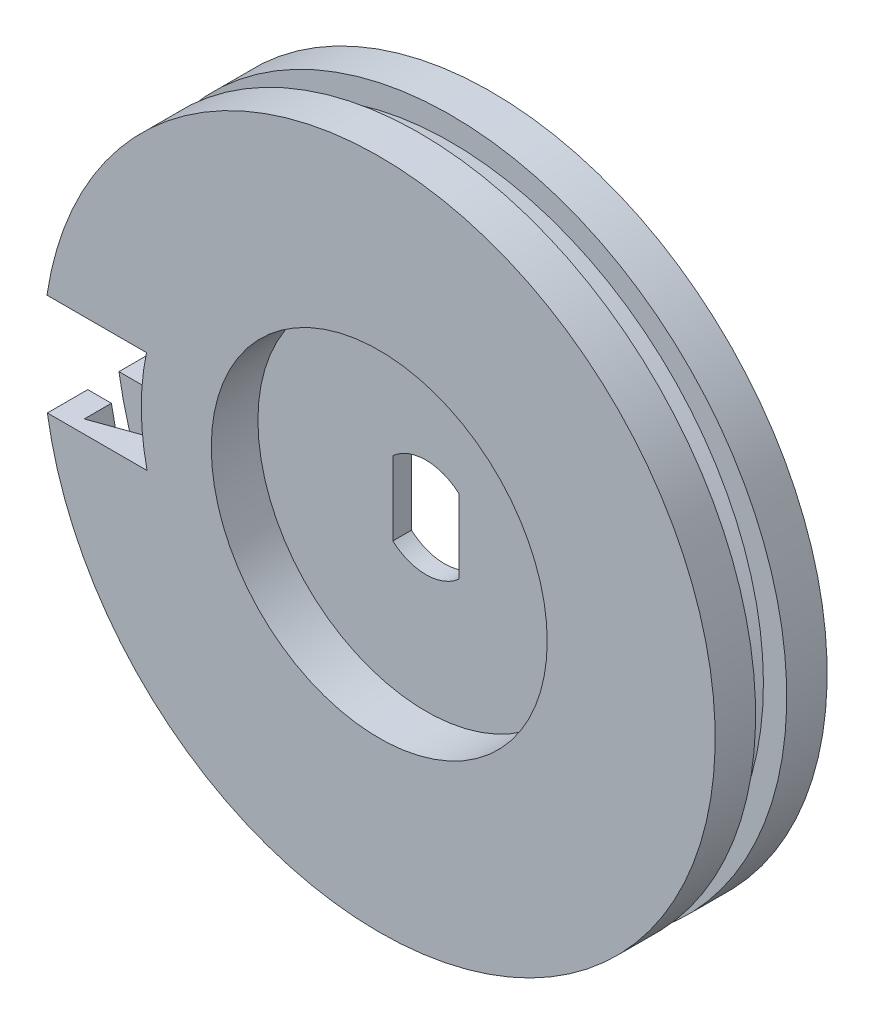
ISO-10303-21;
HEADER;
FILE_DESCRIPTION(('STEP AP214'),'2;1');
FILE_NAME('part.step','',(''),(''),'','','');
FILE_SCHEMA(('AUTOMOTIVE_DESIGN { 1 0 10303 214 1 1 1 1 }'));
ENDSEC;
DATA;
#1=APPLICATION_CONTEXT('core data for automotive mechanical design processes');
#2=APPLICATION_PROTOCOL_DEFINITION('international standard','automotive_design',2000,#1);
#3=PRODUCT_CONTEXT('',#1,'mechanical');
#4=PRODUCT('Part','Part','',(#3));
#5=PRODUCT_RELATED_PRODUCT_CATEGORY('part','',(#4));
#6=PRODUCT_DEFINITION_FORMATION('','',#4);
#7=PRODUCT_DEFINITION_CONTEXT('part definition',#1,'design');
#8=PRODUCT_DEFINITION('design','',#6,#7);
#9=PRODUCT_DEFINITION_SHAPE('','',#8);
#10=(LENGTH_UNIT() NAMED_UNIT(*) SI_UNIT(.MILLI.,.METRE.));
#11=(NAMED_UNIT(*) PLANE_ANGLE_UNIT() SI_UNIT($,.RADIAN.));
#12=(NAMED_UNIT(*) SI_UNIT($,.STERADIAN.) SOLID_ANGLE_UNIT());
#13=UNCERTAINTY_MEASURE_WITH_UNIT(LENGTH_MEASURE(1.E-05),#10,'distance_accuracy_value','');
#14=(GEOMETRIC_REPRESENTATION_CONTEXT(3) GLOBAL_UNCERTAINTY_ASSIGNED_CONTEXT((#13)) GLOBAL_UNIT_ASSIGNED_CONTEXT((#10,
#11,#12)) REPRESENTATION_CONTEXT('',''));
#15=CARTESIAN_POINT('',(0.,0.,0.));
#16=DIRECTION('',(0.,0.,1.));
#17=DIRECTION('',(1.,0.,0.));
#18=AXIS2_PLACEMENT_3D('',#15,#16,#17);
#19=CARTESIAN_POINT('',(0.,0.,2.77594898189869));
#20=DIRECTION('',(0.,0.,1.));
#21=DIRECTION('',(1.,0.,0.));
#22=AXIS2_PLACEMENT_3D('',#19,#20,#21);
#23=CONICAL_SURFACE('',#22,18.288,1.22173047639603);
#24=CARTESIAN_POINT('',(0.,0.,1.00093894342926));
#25=DIRECTION('',(0.,0.,-1.));
#26=DIRECTION('',(-1.,0.,0.));
#27=AXIS2_PLACEMENT_3D('',#24,#25,#26);
#28=CIRCLE('',#27,13.4112);
#29=CARTESIAN_POINT('',(-13.1365331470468,2.70033003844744,1.00093894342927));
#30=VERTEX_POINT('',#29);
#31=CARTESIAN_POINT('',(-13.1068533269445,-2.84089445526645,1.00093894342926));
#32=VERTEX_POINT('',#31);
#33=EDGE_CURVE('E314',#30,#32,#28,.T.);
#34=ORIENTED_EDGE('',*,*,#33,.F.);
#35=CARTESIAN_POINT('',(-8.04375403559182,2.70033003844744,-0.792082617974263));
#36=CARTESIAN_POINT('',(-8.38888733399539,2.70033003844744,-0.672968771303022));
#37=CARTESIAN_POINT('',(-8.73379741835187,2.70033003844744,-0.553211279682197));
#38=CARTESIAN_POINT('',(-9.42326645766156,2.70033003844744,-0.312692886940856));
#39=CARTESIAN_POINT('',(-9.76782541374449,2.70033003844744,-0.19193198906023));
#40=CARTESIAN_POINT('',(-10.4566871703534,2.70033003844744,0.0503092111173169));
#41=CARTESIAN_POINT('',(-10.800989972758,2.70033003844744,0.17178950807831));
#42=CARTESIAN_POINT('',(-11.4893997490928,2.70033003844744,0.415304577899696));
#43=CARTESIAN_POINT('',(-11.8335067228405,2.70033003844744,0.537339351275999));
#44=CARTESIAN_POINT('',(-12.8655944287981,2.70033003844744,0.904076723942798));
#45=CARTESIAN_POINT('',(-13.5533492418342,2.70033003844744,1.14941494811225));
#46=CARTESIAN_POINT('',(-14.928476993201,2.70033003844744,1.64116284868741));
#47=CARTESIAN_POINT('',(-15.6158499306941,2.70033003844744,1.8875725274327));
#48=CARTESIAN_POINT('',(-16.9903265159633,2.70033003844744,2.3811171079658));
#49=CARTESIAN_POINT('',(-17.6774301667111,2.70033003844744,2.62825200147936));
#50=CARTESIAN_POINT('',(-19.0514516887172,2.70033003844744,3.12303554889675));
#51=CARTESIAN_POINT('',(-19.7383695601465,2.70033003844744,3.37068420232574));
#52=CARTESIAN_POINT('',(-21.112075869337,2.70033003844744,3.86635878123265));
#53=CARTESIAN_POINT('',(-21.798864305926,2.70033003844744,4.11438470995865));
#54=CARTESIAN_POINT('',(-23.1723369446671,2.70033003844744,4.61072482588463));
#55=CARTESIAN_POINT('',(-23.8590211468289,2.70033003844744,4.85903901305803));
#56=CARTESIAN_POINT('',(-24.5456688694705,2.70033003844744,5.10745391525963));
#57=B_SPLINE_CURVE_WITH_KNOTS('',3,(#35,#36,#37,#38,#39,#40,#41,#42,#43,#44,#45,#46,#47,#48,#49,
#50,#51,#52,#53,#54,#55,#56),.UNSPECIFIED.,.F.,.F.,(4,2,2,2,2,2,2,2,2,2,4),(0.,1.09532704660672,
2.19065055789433,3.28596595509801,4.38128237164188,6.57189199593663,8.7625064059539,
10.9530959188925,13.143683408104,15.334289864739,17.5248961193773),.UNSPECIFIED.);
#58=CARTESIAN_POINT('',(-16.802396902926,2.70033003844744,2.31370678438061));
#59=VERTEX_POINT('',#58);
#60=EDGE_CURVE('E278',#30,#59,#57,.T.);
#61=ORIENTED_EDGE('',*,*,#60,.T.);
#62=CARTESIAN_POINT('',(0.,0.,2.31370678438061));
#63=DIRECTION('',(0.,0.,1.));
#64=DIRECTION('',(1.,0.,0.));
#65=AXIS2_PLACEMENT_3D('',#62,#63,#64);
#66=CIRCLE('',#65,17.018);
#67=CARTESIAN_POINT('',(-16.7792026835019,-2.84089445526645,2.31370678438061));
#68=VERTEX_POINT('',#67);
#69=EDGE_CURVE('E348',#68,#59,#66,.T.);
#70=ORIENTED_EDGE('',*,*,#69,.F.);
#71=CARTESIAN_POINT('',(-24.5872319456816,-2.84089445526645,5.12821989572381));
#72=CARTESIAN_POINT('',(-23.8966532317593,-2.84089445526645,4.87853732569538));
#73=CARTESIAN_POINT('',(-23.2060339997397,-2.84089445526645,4.62896667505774));
#74=CARTESIAN_POINT('',(-21.8246796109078,-2.84089445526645,4.13014617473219));
#75=CARTESIAN_POINT('',(-21.1339444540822,-2.84089445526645,3.88089632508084));
#76=CARTESIAN_POINT('',(-19.7523308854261,-2.84089445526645,3.3828171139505));
#77=CARTESIAN_POINT('',(-19.0614524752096,-2.84089445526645,3.13398774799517));
#78=CARTESIAN_POINT('',(-17.6794886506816,-2.84089445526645,2.63690181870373));
#79=CARTESIAN_POINT('',(-16.988403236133,-2.84089445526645,2.38864525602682));
#80=CARTESIAN_POINT('',(-15.6059311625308,-2.84089445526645,1.89294138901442));
#81=CARTESIAN_POINT('',(-14.9145444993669,-2.84089445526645,1.64549409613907));
#82=CARTESIAN_POINT('',(-13.5313451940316,-2.84089445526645,1.15179746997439));
#83=CARTESIAN_POINT('',(-12.8395325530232,-2.84089445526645,0.905548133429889));
#84=CARTESIAN_POINT('',(-11.8013042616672,-2.84089445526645,0.537596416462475));
#85=CARTESIAN_POINT('',(-11.4551410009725,-2.84089445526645,0.415182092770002));
#86=CARTESIAN_POINT('',(-10.76259562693,-2.84089445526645,0.1709751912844));
#87=CARTESIAN_POINT('',(-10.4162135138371,-2.84089445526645,0.0491826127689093));
#88=CARTESIAN_POINT('',(-9.7231625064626,-2.84089445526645,-0.193595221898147));
#89=CARTESIAN_POINT('',(-9.3764936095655,-2.84089445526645,-0.314580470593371));
#90=CARTESIAN_POINT('',(-8.68276299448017,-2.84089445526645,-0.555423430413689));
#91=CARTESIAN_POINT('',(-8.33570127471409,-2.84089445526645,-0.675281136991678));
#92=CARTESIAN_POINT('',(-7.98838992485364,-2.84089445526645,-0.794415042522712));
#93=B_SPLINE_CURVE_WITH_KNOTS('',3,(#71,#72,#73,#74,#75,#76,#77,#78,#79,#80,#81,#82,#83,#84,#85,
#86,#87,#88,#89,#90,#91,#92),.UNSPECIFIED.,.F.,.F.,(4,2,2,2,2,2,2,2,2,2,4),(0.,2.20298965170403,
4.40597955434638,6.60894585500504,8.81191468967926,11.0149145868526,13.2179084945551,
14.3194199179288,15.4209300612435,16.5224503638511,17.623975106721),.UNSPECIFIED.);
#94=EDGE_CURVE('E209',#68,#32,#93,.T.);
#95=ORIENTED_EDGE('',*,*,#94,.T.);
#96=EDGE_LOOP('',(#34,#61,#70,#95));
#97=FACE_BOUND('',#96,.T.);
#98=ADVANCED_FACE('F37',(#97),#23,.T.);
#99=CARTESIAN_POINT('',(0.,0.,-1.03106105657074));
#100=DIRECTION('',(0.,0.,-1.));
#101=DIRECTION('',(-1.,0.,0.));
#102=AXIS2_PLACEMENT_3D('',#99,#100,#101);
#103=CONICAL_SURFACE('',#102,13.4112,1.22173047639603);
#104=CARTESIAN_POINT('',(0.,0.,-2.34382889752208));
#105=DIRECTION('',(0.,0.,-1.));
#106=DIRECTION('',(-1.,0.,0.));
#107=AXIS2_PLACEMENT_3D('',#104,#105,#106);
#108=CIRCLE('',#107,17.018);
#109=CARTESIAN_POINT('',(-16.802396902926,2.70033003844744,-2.34382889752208));
#110=VERTEX_POINT('',#109);
#111=CARTESIAN_POINT('',(-16.7792026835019,-2.84089445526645,-2.34382889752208));
#112=VERTEX_POINT('',#111);
#113=EDGE_CURVE('E307',#110,#112,#108,.T.);
#114=ORIENTED_EDGE('',*,*,#113,.F.);
#115=CARTESIAN_POINT('',(-24.5456688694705,2.70033003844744,-5.1375760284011));
#116=CARTESIAN_POINT('',(-23.8590211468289,2.70033003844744,-4.8891611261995));
#117=CARTESIAN_POINT('',(-23.1723369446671,2.70033003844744,-4.6408469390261));
#118=CARTESIAN_POINT('',(-21.798864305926,2.70033003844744,-4.14450682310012));
#119=CARTESIAN_POINT('',(-21.112075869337,2.70033003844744,-3.89648089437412));
#120=CARTESIAN_POINT('',(-19.7383695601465,2.70033003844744,-3.40080631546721));
#121=CARTESIAN_POINT('',(-19.0514516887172,2.70033003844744,-3.15315766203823));
#122=CARTESIAN_POINT('',(-17.6774301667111,2.70033003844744,-2.65837411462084));
#123=CARTESIAN_POINT('',(-16.9903265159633,2.70033003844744,-2.41123922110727));
#124=CARTESIAN_POINT('',(-15.6158499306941,2.70033003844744,-1.91769464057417));
#125=CARTESIAN_POINT('',(-14.928476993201,2.70033003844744,-1.67128496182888));
#126=CARTESIAN_POINT('',(-13.5533492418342,2.70033003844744,-1.17953706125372));
#127=CARTESIAN_POINT('',(-12.8655944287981,2.70033003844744,-0.934198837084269));
#128=CARTESIAN_POINT('',(-11.8335067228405,2.70033003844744,-0.567461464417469));
#129=CARTESIAN_POINT('',(-11.4893997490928,2.70033003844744,-0.445426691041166));
#130=CARTESIAN_POINT('',(-10.800989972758,2.70033003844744,-0.20191162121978));
#131=CARTESIAN_POINT('',(-10.4566871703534,2.70033003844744,-0.0804313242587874));
#132=CARTESIAN_POINT('',(-9.76782541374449,2.70033003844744,0.161809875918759));
#133=CARTESIAN_POINT('',(-9.42326645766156,2.70033003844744,0.282570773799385));
#134=CARTESIAN_POINT('',(-8.73379741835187,2.70033003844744,0.523089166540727));
#135=CARTESIAN_POINT('',(-8.38888733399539,2.70033003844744,0.642846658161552));
#136=CARTESIAN_POINT('',(-8.04375403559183,2.70033003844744,0.761960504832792));
#137=B_SPLINE_CURVE_WITH_KNOTS('',3,(#115,#116,#117,#118,#119,#120,#121,#122,#123,#124,#125,
#126,#127,#128,#129,#130,#131,#132,#133,#134,#135,#136),.UNSPECIFIED.,.F.,.F.,(4,2,2,2,2,2,2,2,
2,2,4),(0.,2.19060625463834,4.38121271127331,6.57180020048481,8.7623897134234,10.9530041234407,
13.1436137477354,14.2389301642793,15.334245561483,16.4295690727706,17.5248961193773),.UNSPECIFIED.);
#138=CARTESIAN_POINT('',(-13.1365331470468,2.70033003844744,-1.03106105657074));
#139=VERTEX_POINT('',#138);
#140=EDGE_CURVE('E257',#110,#139,#137,.T.);
#141=ORIENTED_EDGE('',*,*,#140,.T.);
#142=CARTESIAN_POINT('',(0.,0.,-1.03106105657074));
#143=DIRECTION('',(0.,0.,-1.));
#144=DIRECTION('',(-1.,0.,0.));
#145=AXIS2_PLACEMENT_3D('',#142,#143,#144);
#146=CIRCLE('',#145,13.4112);
#147=CARTESIAN_POINT('',(-13.1068533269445,-2.84089445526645,-1.03106105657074));
#148=VERTEX_POINT('',#147);
#149=EDGE_CURVE('E323',#139,#148,#146,.T.);
#150=ORIENTED_EDGE('',*,*,#149,.T.);
#151=CARTESIAN_POINT('',(-7.98838992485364,-2.84089445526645,0.764292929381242));
#152=CARTESIAN_POINT('',(-8.3357012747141,-2.84089445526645,0.645159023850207));
#153=CARTESIAN_POINT('',(-8.68276299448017,-2.84089445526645,0.525301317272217));
#154=CARTESIAN_POINT('',(-9.37649360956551,-2.84089445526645,0.2844583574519));
#155=CARTESIAN_POINT('',(-9.7231625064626,-2.84089445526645,0.163473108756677));
#156=CARTESIAN_POINT('',(-10.4162135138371,-2.84089445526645,-0.0793047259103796));
#157=CARTESIAN_POINT('',(-10.76259562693,-2.84089445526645,-0.201097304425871));
#158=CARTESIAN_POINT('',(-11.4551410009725,-2.84089445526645,-0.445304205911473));
#159=CARTESIAN_POINT('',(-11.8013042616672,-2.84089445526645,-0.567718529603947));
#160=CARTESIAN_POINT('',(-12.8395325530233,-2.84089445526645,-0.935670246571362));
#161=CARTESIAN_POINT('',(-13.5313451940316,-2.84089445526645,-1.18191958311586));
#162=CARTESIAN_POINT('',(-14.914544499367,-2.84089445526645,-1.67561620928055));
#163=CARTESIAN_POINT('',(-15.6059311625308,-2.84089445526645,-1.9230635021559));
#164=CARTESIAN_POINT('',(-16.988403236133,-2.84089445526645,-2.41876736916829));
#165=CARTESIAN_POINT('',(-17.6794886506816,-2.84089445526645,-2.6670239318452));
#166=CARTESIAN_POINT('',(-19.0614524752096,-2.84089445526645,-3.16410986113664));
#167=CARTESIAN_POINT('',(-19.7523308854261,-2.84089445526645,-3.41293922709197));
#168=CARTESIAN_POINT('',(-21.1339444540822,-2.84089445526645,-3.91101843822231));
#169=CARTESIAN_POINT('',(-21.8246796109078,-2.84089445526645,-4.16026828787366));
#170=CARTESIAN_POINT('',(-23.2060339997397,-2.84089445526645,-4.65908878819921));
#171=CARTESIAN_POINT('',(-23.8966532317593,-2.84089445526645,-4.90865943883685));
#172=CARTESIAN_POINT('',(-24.5872319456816,-2.84089445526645,-5.15834200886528));
#173=B_SPLINE_CURVE_WITH_KNOTS('',3,(#151,#152,#153,#154,#155,#156,#157,#158,#159,#160,#161,
#162,#163,#164,#165,#166,#167,#168,#169,#170,#171,#172),.UNSPECIFIED.,.F.,.F.,(4,2,2,2,2,2,2,2,
2,2,4),(0.,1.10152474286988,2.20304504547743,3.30455518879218,4.4060666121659,6.60906051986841,
8.8120604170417,11.0150292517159,13.2179955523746,15.4209854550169,17.623975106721),.UNSPECIFIED.);
#174=EDGE_CURVE('E236',#148,#112,#173,.T.);
#175=ORIENTED_EDGE('',*,*,#174,.T.);
#176=EDGE_LOOP('',(#114,#141,#150,#175));
#177=FACE_BOUND('',#176,.T.);
#178=ADVANCED_FACE('F246',(#177),#103,.T.);
#179=CARTESIAN_POINT('',(0.,0.,-0.0150610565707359));
#180=DIRECTION('',(0.,0.,1.));
#181=DIRECTION('',(1.,0.,0.));
#182=AXIS2_PLACEMENT_3D('',#179,#180,#181);
#183=CYLINDRICAL_SURFACE('',#182,18.288);
#184=CARTESIAN_POINT('',(0.,0.,-3.06306105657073));
#185=DIRECTION('',(0.,0.,1.));
#186=DIRECTION('',(1.,0.,0.));
#187=AXIS2_PLACEMENT_3D('',#184,#185,#186);
#188=CIRCLE('',#187,18.288);
#189=CARTESIAN_POINT('',(-18.0659974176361,-2.84089445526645,-3.06306105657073));
#190=VERTEX_POINT('',#189);
#191=CARTESIAN_POINT('',(-18.0875416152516,2.70033003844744,-3.06306105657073));
#192=VERTEX_POINT('',#191);
#193=EDGE_CURVE('E329',#190,#192,#188,.T.);
#194=ORIENTED_EDGE('',*,*,#193,.T.);
#195=DIRECTION('',(0.,0.,1.));
#196=VECTOR('',#195,1.);
#197=CARTESIAN_POINT('',(-18.0875416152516,2.70033003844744,-0.0150610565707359));
#198=LINE('',#197,#196);
#199=CARTESIAN_POINT('',(-18.0875416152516,2.70033003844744,-0.863061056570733));
#200=VERTEX_POINT('',#199);
#201=EDGE_CURVE('E397',#192,#200,#198,.T.);
#202=ORIENTED_EDGE('',*,*,#201,.T.);
#203=CARTESIAN_POINT('',(0.,0.,-0.863061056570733));
#204=DIRECTION('',(0.,0.,-1.));
#205=DIRECTION('',(-1.,0.,0.));
#206=AXIS2_PLACEMENT_3D('',#203,#204,#205);
#207=CIRCLE('',#206,18.288);
#208=CARTESIAN_POINT('',(-18.0659974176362,-2.84089445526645,-0.863061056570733));
#209=VERTEX_POINT('',#208);
#210=EDGE_CURVE('E311',#200,#209,#207,.T.);
#211=ORIENTED_EDGE('',*,*,#210,.T.);
#212=DIRECTION('',(0.,0.,1.));
#213=VECTOR('',#212,1.);
#214=CARTESIAN_POINT('',(-18.0659974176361,-2.84089445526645,-0.0150610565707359));
#215=LINE('',#214,#213);
#216=EDGE_CURVE('E291',#209,#190,#215,.F.);
#217=ORIENTED_EDGE('',*,*,#216,.T.);
#218=EDGE_LOOP('',(#194,#202,#211,#217));
#219=FACE_BOUND('',#218,.T.);
#220=ADVANCED_FACE('F250',(#219),#183,.T.);
#221=CARTESIAN_POINT('',(0.,0.,3.03293894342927));
#222=DIRECTION('',(0.,0.,1.));
#223=DIRECTION('',(1.,0.,0.));
#224=AXIS2_PLACEMENT_3D('',#221,#222,#223);
#225=PLANE('',#224);
#226=DIRECTION('',(-1.,0.,0.));
#227=VECTOR('',#226,1.);
#228=CARTESIAN_POINT('',(-12.6694251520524,2.70033003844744,3.03293894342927));
#229=LINE('',#228,#227);
#230=CARTESIAN_POINT('',(-12.6694251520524,2.70033003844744,3.03293894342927));
#231=VERTEX_POINT('',#230);
#232=CARTESIAN_POINT('',(-18.0875416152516,2.70033003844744,3.03293894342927));
#233=VERTEX_POINT('',#232);
#234=EDGE_CURVE('E186',#231,#233,#229,.T.);
#235=ORIENTED_EDGE('',*,*,#234,.F.);
#236=CARTESIAN_POINT('',(0.,0.,3.03293894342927));
#237=DIRECTION('',(0.,0.,-1.));
#238=DIRECTION('',(1.,0.,0.));
#239=AXIS2_PLACEMENT_3D('',#236,#237,#238);
#240=CIRCLE('',#239,12.954);
#241=CARTESIAN_POINT('',(-12.6386484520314,-2.84089445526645,3.03293894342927));
#242=VERTEX_POINT('',#241);
#243=EDGE_CURVE('E195',#242,#231,#240,.T.);
#244=ORIENTED_EDGE('',*,*,#243,.F.);
#245=DIRECTION('',(1.,0.,0.));
#246=VECTOR('',#245,1.);
#247=CARTESIAN_POINT('',(-12.6386484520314,-2.84089445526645,3.03293894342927));
#248=LINE('',#247,#246);
#249=CARTESIAN_POINT('',(-18.0659974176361,-2.84089445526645,3.03293894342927));
#250=VERTEX_POINT('',#249);
#251=EDGE_CURVE('E193',#250,#242,#248,.T.);
#252=ORIENTED_EDGE('',*,*,#251,.F.);
#253=CARTESIAN_POINT('',(0.,0.,3.03293894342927));
#254=DIRECTION('',(0.,0.,1.));
#255=DIRECTION('',(1.,0.,0.));
#256=AXIS2_PLACEMENT_3D('',#253,#254,#255);
#257=CIRCLE('',#256,18.288);
#258=EDGE_CURVE('E326',#250,#233,#257,.T.);
#259=ORIENTED_EDGE('',*,*,#258,.T.);
#260=EDGE_LOOP('',(#235,#244,#252,#259));
#261=FACE_BOUND('',#260,.T.);
#262=CARTESIAN_POINT('',(0.,0.,3.03293894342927));
#263=DIRECTION('',(0.,0.,1.));
#264=DIRECTION('',(1.,0.,0.));
#265=AXIS2_PLACEMENT_3D('',#262,#263,#264);
#266=CIRCLE('',#265,9.144);
#267=CARTESIAN_POINT('',(9.14400000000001,0.,3.03293894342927));
#268=VERTEX_POINT('',#267);
#269=EDGE_CURVE('E338',#268,#268,#266,.T.);
#270=ORIENTED_EDGE('',*,*,#269,.F.);
#271=EDGE_LOOP('',(#270));
#272=FACE_BOUND('',#271,.T.);
#273=ADVANCED_FACE('F411',(#261,#272),#225,.T.);
#274=CARTESIAN_POINT('',(0.,0.,-0.0150610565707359));
#275=DIRECTION('',(0.,0.,1.));
#276=DIRECTION('',(1.,0.,0.));
#277=AXIS2_PLACEMENT_3D('',#274,#275,#276);
#278=CYLINDRICAL_SURFACE('',#277,9.144);
#279=ORIENTED_EDGE('',*,*,#269,.T.);
#280=EDGE_LOOP('',(#279));
#281=FACE_BOUND('',#280,.T.);
#282=CARTESIAN_POINT('',(0.,0.,0.492938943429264));
#283=DIRECTION('',(0.,0.,1.));
#284=DIRECTION('',(1.,0.,0.));
#285=AXIS2_PLACEMENT_3D('',#282,#283,#284);
#286=CIRCLE('',#285,9.144);
#287=CARTESIAN_POINT('',(9.14400000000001,0.,0.492938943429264));
#288=VERTEX_POINT('',#287);
#289=EDGE_CURVE('E335',#288,#288,#286,.T.);
#290=ORIENTED_EDGE('',*,*,#289,.F.);
#291=EDGE_LOOP('',(#290));
#292=FACE_BOUND('',#291,.T.);
#293=ADVANCED_FACE('F481',(#281,#292),#278,.F.);
#294=CARTESIAN_POINT('',(0.,0.,0.492938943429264));
#295=DIRECTION('',(0.,0.,1.));
#296=DIRECTION('',(1.,0.,0.));
#297=AXIS2_PLACEMENT_3D('',#294,#295,#296);
#298=PLANE('',#297);
#299=CARTESIAN_POINT('',(0.,0.,0.492938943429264));
#300=DIRECTION('',(0.,0.,1.));
#301=DIRECTION('',(1.,0.,0.));
#302=AXIS2_PLACEMENT_3D('',#299,#300,#301);
#303=CIRCLE('',#302,2.7);
#304=CARTESIAN_POINT('',(-1.8,-2.01246117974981,0.492938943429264));
#305=VERTEX_POINT('',#304);
#306=CARTESIAN_POINT('',(1.8,-2.01246117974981,0.492938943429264));
#307=VERTEX_POINT('',#306);
#308=EDGE_CURVE('E52',#305,#307,#303,.T.);
#309=ORIENTED_EDGE('',*,*,#308,.F.);
#310=DIRECTION('',(0.,-1.,0.));
#311=VECTOR('',#310,1.);
#312=CARTESIAN_POINT('',(-1.8,-2.01246117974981,0.492938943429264));
#313=LINE('',#312,#311);
#314=CARTESIAN_POINT('',(-1.8,2.01246117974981,0.492938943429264));
#315=VERTEX_POINT('',#314);
#316=EDGE_CURVE('E169',#315,#305,#313,.T.);
#317=ORIENTED_EDGE('',*,*,#316,.F.);
#318=CARTESIAN_POINT('',(0.,0.,0.492938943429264));
#319=DIRECTION('',(0.,0.,1.));
#320=DIRECTION('',(1.,0.,0.));
#321=AXIS2_PLACEMENT_3D('',#318,#319,#320);
#322=CIRCLE('',#321,2.7);
#323=CARTESIAN_POINT('',(1.8,2.01246117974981,0.492938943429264));
#324=VERTEX_POINT('',#323);
#325=EDGE_CURVE('E153',#324,#315,#322,.T.);
#326=ORIENTED_EDGE('',*,*,#325,.F.);
#327=DIRECTION('',(0.,1.,0.));
#328=VECTOR('',#327,1.);
#329=CARTESIAN_POINT('',(1.8,-2.01246117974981,0.492938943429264));
#330=LINE('',#329,#328);
#331=EDGE_CURVE('E162',#307,#324,#330,.T.);
#332=ORIENTED_EDGE('',*,*,#331,.F.);
#333=EDGE_LOOP('',(#309,#317,#326,#332));
#334=FACE_BOUND('',#333,.T.);
#335=ORIENTED_EDGE('',*,*,#289,.T.);
#336=EDGE_LOOP('',(#335));
#337=FACE_BOUND('',#336,.T.);
#338=ADVANCED_FACE('F166',(#334,#337),#298,.T.);
#339=CARTESIAN_POINT('',(0.,0.,-0.523061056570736));
#340=DIRECTION('',(0.,0.,1.));
#341=DIRECTION('',(1.,0.,0.));
#342=AXIS2_PLACEMENT_3D('',#339,#340,#341);
#343=PLANE('',#342);
#344=DIRECTION('',(0.,-1.,0.));
#345=VECTOR('',#344,1.);
#346=CARTESIAN_POINT('',(-1.8,0.,-0.523061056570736));
#347=LINE('',#346,#345);
#348=CARTESIAN_POINT('',(-1.8,2.01246117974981,-0.523061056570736));
#349=VERTEX_POINT('',#348);
#350=CARTESIAN_POINT('',(-1.8,-2.01246117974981,-0.523061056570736));
#351=VERTEX_POINT('',#350);
#352=EDGE_CURVE('E45',#349,#351,#347,.T.);
#353=ORIENTED_EDGE('',*,*,#352,.T.);
#354=CARTESIAN_POINT('',(0.,0.,-0.523061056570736));
#355=DIRECTION('',(0.,0.,1.));
#356=DIRECTION('',(1.,0.,0.));
#357=AXIS2_PLACEMENT_3D('',#354,#355,#356);
#358=CIRCLE('',#357,2.7);
#359=CARTESIAN_POINT('',(1.8,-2.01246117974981,-0.523061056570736));
#360=VERTEX_POINT('',#359);
#361=EDGE_CURVE('E11',#351,#360,#358,.T.);
#362=ORIENTED_EDGE('',*,*,#361,.T.);
#363=DIRECTION('',(0.,1.,0.));
#364=VECTOR('',#363,1.);
#365=CARTESIAN_POINT('',(1.8,0.,-0.523061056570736));
#366=LINE('',#365,#364);
#367=CARTESIAN_POINT('',(1.8,2.01246117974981,-0.523061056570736));
#368=VERTEX_POINT('',#367);
#369=EDGE_CURVE('E357',#360,#368,#366,.T.);
#370=ORIENTED_EDGE('',*,*,#369,.T.);
#371=CARTESIAN_POINT('',(0.,0.,-0.523061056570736));
#372=DIRECTION('',(0.,0.,1.));
#373=DIRECTION('',(1.,0.,0.));
#374=AXIS2_PLACEMENT_3D('',#371,#372,#373);
#375=CIRCLE('',#374,2.7);
#376=EDGE_CURVE('E156',#368,#349,#375,.T.);
#377=ORIENTED_EDGE('',*,*,#376,.T.);
#378=EDGE_LOOP('',(#353,#362,#370,#377));
#379=FACE_BOUND('',#378,.T.);
#380=CARTESIAN_POINT('',(0.,0.,-0.523061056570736));
#381=DIRECTION('',(0.,0.,1.));
#382=DIRECTION('',(1.,0.,0.));
#383=AXIS2_PLACEMENT_3D('',#380,#381,#382);
#384=CIRCLE('',#383,8.128);
#385=CARTESIAN_POINT('',(8.12800000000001,0.,-0.523061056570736));
#386=VERTEX_POINT('',#385);
#387=EDGE_CURVE('E344',#386,#386,#384,.F.);
#388=ORIENTED_EDGE('',*,*,#387,.T.);
#389=EDGE_LOOP('',(#388));
#390=FACE_BOUND('',#389,.T.);
#391=ADVANCED_FACE('F366',(#379,#390),#343,.F.);
#392=CARTESIAN_POINT('',(0.,0.,-1.53906105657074));
#393=DIRECTION('',(0.,0.,1.));
#394=DIRECTION('',(1.,0.,0.));
#395=AXIS2_PLACEMENT_3D('',#392,#393,#394);
#396=CIRCLE('',#395,9.144);
#397=CARTESIAN_POINT('',(9.14400000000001,0.,-1.53906105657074));
#398=VERTEX_POINT('',#397);
#399=EDGE_CURVE('E341',#398,#398,#396,.T.);
#400=ORIENTED_EDGE('',*,*,#399,.T.);
#401=EDGE_LOOP('',(#400));
#402=FACE_BOUND('',#401,.T.);
#403=CARTESIAN_POINT('',(0.,0.,-3.06306105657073));
#404=DIRECTION('',(0.,0.,1.));
#405=DIRECTION('',(1.,0.,0.));
#406=AXIS2_PLACEMENT_3D('',#403,#404,#405);
#407=CIRCLE('',#406,9.144);
#408=CARTESIAN_POINT('',(9.14400000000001,0.,-3.06306105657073));
#409=VERTEX_POINT('',#408);
#410=EDGE_CURVE('E332',#409,#409,#407,.T.);
#411=ORIENTED_EDGE('',*,*,#410,.F.);
#412=EDGE_LOOP('',(#411));
#413=FACE_BOUND('',#412,.T.);
#414=ADVANCED_FACE('F492',(#402,#413),#278,.F.);
#415=CARTESIAN_POINT('',(0.,0.,-3.06306105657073));
#416=DIRECTION('',(0.,0.,1.));
#417=DIRECTION('',(1.,0.,0.));
#418=AXIS2_PLACEMENT_3D('',#415,#416,#417);
#419=PLANE('',#418);
#420=CARTESIAN_POINT('',(0.,0.,-3.06306105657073));
#421=DIRECTION('',(0.,0.,-1.));
#422=DIRECTION('',(1.,0.,0.));
#423=AXIS2_PLACEMENT_3D('',#420,#421,#422);
#424=CIRCLE('',#423,12.954);
#425=CARTESIAN_POINT('',(-12.6386484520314,-2.84089445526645,-3.06306105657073));
#426=VERTEX_POINT('',#425);
#427=CARTESIAN_POINT('',(-12.6694251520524,2.70033003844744,-3.06306105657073));
#428=VERTEX_POINT('',#427);
#429=EDGE_CURVE('E185',#426,#428,#424,.T.);
#430=ORIENTED_EDGE('',*,*,#429,.T.);
#431=DIRECTION('',(-1.,0.,0.));
#432=VECTOR('',#431,1.);
#433=CARTESIAN_POINT('',(-12.6694251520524,2.70033003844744,-3.06306105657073));
#434=LINE('',#433,#432);
#435=EDGE_CURVE('E189',#428,#192,#434,.T.);
#436=ORIENTED_EDGE('',*,*,#435,.T.);
#437=ORIENTED_EDGE('',*,*,#193,.F.);
#438=DIRECTION('',(1.,0.,0.));
#439=VECTOR('',#438,1.);
#440=CARTESIAN_POINT('',(-12.6386484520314,-2.84089445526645,-3.06306105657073));
#441=LINE('',#440,#439);
#442=EDGE_CURVE('E182',#190,#426,#441,.T.);
#443=ORIENTED_EDGE('',*,*,#442,.T.);
#444=EDGE_LOOP('',(#430,#436,#437,#443));
#445=FACE_BOUND('',#444,.T.);
#446=ORIENTED_EDGE('',*,*,#410,.T.);
#447=EDGE_LOOP('',(#446));
#448=FACE_BOUND('',#447,.T.);
#449=ADVANCED_FACE('F403',(#445,#448),#419,.F.);
#450=CARTESIAN_POINT('',(0.,0.,0.832938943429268));
#451=DIRECTION('',(0.,0.,1.));
#452=DIRECTION('',(1.,0.,0.));
#453=AXIS2_PLACEMENT_3D('',#450,#451,#452);
#454=CIRCLE('',#453,18.288);
#455=CARTESIAN_POINT('',(-18.0659974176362,-2.84089445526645,0.832938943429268));
#456=VERTEX_POINT('',#455);
#457=CARTESIAN_POINT('',(-18.0875416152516,2.70033003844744,0.832938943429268));
#458=VERTEX_POINT('',#457);
#459=EDGE_CURVE('E312',#456,#458,#454,.T.);
#460=ORIENTED_EDGE('',*,*,#459,.T.);
#461=DIRECTION('',(0.,0.,1.));
#462=VECTOR('',#461,1.);
#463=CARTESIAN_POINT('',(-18.0875416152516,2.70033003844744,-0.0150610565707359));
#464=LINE('',#463,#462);
#465=EDGE_CURVE('E285',#458,#233,#464,.T.);
#466=ORIENTED_EDGE('',*,*,#465,.T.);
#467=ORIENTED_EDGE('',*,*,#258,.F.);
#468=DIRECTION('',(0.,0.,1.));
#469=VECTOR('',#468,1.);
#470=CARTESIAN_POINT('',(-18.0659974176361,-2.84089445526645,-0.0150610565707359));
#471=LINE('',#470,#469);
#472=EDGE_CURVE('E206',#250,#456,#471,.F.);
#473=ORIENTED_EDGE('',*,*,#472,.T.);
#474=EDGE_LOOP('',(#460,#466,#467,#473));
#475=FACE_BOUND('',#474,.T.);
#476=ADVANCED_FACE('F253',(#475),#183,.T.);
#477=CARTESIAN_POINT('',(0.,0.,-0.0150610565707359));
#478=DIRECTION('',(0.,0.,-1.));
#479=DIRECTION('',(-1.,0.,0.));
#480=AXIS2_PLACEMENT_3D('',#477,#478,#479);
#481=CYLINDRICAL_SURFACE('',#480,13.4112);
#482=ORIENTED_EDGE('',*,*,#149,.F.);
#483=DIRECTION('',(0.,0.,-1.));
#484=VECTOR('',#483,1.);
#485=CARTESIAN_POINT('',(-13.1365331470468,2.70033003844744,-0.0150610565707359));
#486=LINE('',#485,#484);
#487=EDGE_CURVE('E266',#139,#30,#486,.F.);
#488=ORIENTED_EDGE('',*,*,#487,.T.);
#489=ORIENTED_EDGE('',*,*,#33,.T.);
#490=DIRECTION('',(0.,0.,-1.));
#491=VECTOR('',#490,1.);
#492=CARTESIAN_POINT('',(-13.1068533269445,-2.84089445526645,-0.0150610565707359));
#493=LINE('',#492,#491);
#494=EDGE_CURVE('E218',#32,#148,#493,.T.);
#495=ORIENTED_EDGE('',*,*,#494,.T.);
#496=EDGE_LOOP('',(#482,#488,#489,#495));
#497=FACE_BOUND('',#496,.T.);
#498=ADVANCED_FACE('F252',(#497),#481,.T.);
#499=CARTESIAN_POINT('',(0.,0.,-1.53906105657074));
#500=DIRECTION('',(0.,0.,1.));
#501=DIRECTION('',(1.,0.,0.));
#502=AXIS2_PLACEMENT_3D('',#499,#500,#501);
#503=TOROIDAL_SURFACE('',#502,8.128,1.016);
#504=ORIENTED_EDGE('',*,*,#387,.F.);
#505=EDGE_LOOP('',(#504));
#506=FACE_BOUND('',#505,.T.);
#507=ORIENTED_EDGE('',*,*,#399,.F.);
#508=EDGE_LOOP('',(#507));
#509=FACE_BOUND('',#508,.T.);
#510=ADVANCED_FACE('F39',(#506,#509),#503,.F.);
#511=CARTESIAN_POINT('',(0.,0.,-0.863061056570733));
#512=DIRECTION('',(0.,0.,-1.));
#513=DIRECTION('',(-1.,0.,0.));
#514=AXIS2_PLACEMENT_3D('',#511,#512,#513);
#515=CYLINDRICAL_SURFACE('',#514,17.018);
#516=CARTESIAN_POINT('',(0.,0.,-0.863061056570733));
#517=DIRECTION('',(0.,0.,-1.));
#518=DIRECTION('',(-1.,0.,0.));
#519=AXIS2_PLACEMENT_3D('',#516,#517,#518);
#520=CIRCLE('',#519,17.018);
#521=CARTESIAN_POINT('',(-16.802396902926,2.70033003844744,-0.863061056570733));
#522=VERTEX_POINT('',#521);
#523=CARTESIAN_POINT('',(-16.7792026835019,-2.84089445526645,-0.863061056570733));
#524=VERTEX_POINT('',#523);
#525=EDGE_CURVE('E305',#522,#524,#520,.T.);
#526=ORIENTED_EDGE('',*,*,#525,.F.);
#527=DIRECTION('',(0.,0.,-1.));
#528=VECTOR('',#527,1.);
#529=CARTESIAN_POINT('',(-16.802396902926,2.70033003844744,-0.863061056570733));
#530=LINE('',#529,#528);
#531=EDGE_CURVE('E265',#522,#110,#530,.T.);
#532=ORIENTED_EDGE('',*,*,#531,.T.);
#533=ORIENTED_EDGE('',*,*,#113,.T.);
#534=DIRECTION('',(0.,0.,-1.));
#535=VECTOR('',#534,1.);
#536=CARTESIAN_POINT('',(-16.7792026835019,-2.84089445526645,-0.863061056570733));
#537=LINE('',#536,#535);
#538=EDGE_CURVE('E244',#112,#524,#537,.F.);
#539=ORIENTED_EDGE('',*,*,#538,.T.);
#540=EDGE_LOOP('',(#526,#532,#533,#539));
#541=FACE_BOUND('',#540,.T.);
#542=ADVANCED_FACE('F303',(#541),#515,.F.);
#543=CARTESIAN_POINT('',(0.,0.,-0.863061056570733));
#544=DIRECTION('',(0.,0.,-1.));
#545=DIRECTION('',(-1.,0.,0.));
#546=AXIS2_PLACEMENT_3D('',#543,#544,#545);
#547=PLANE('',#546);
#548=ORIENTED_EDGE('',*,*,#210,.F.);
#549=DIRECTION('',(1.,0.,0.));
#550=VECTOR('',#549,1.);
#551=CARTESIAN_POINT('',(0.,2.70033003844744,-0.863061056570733));
#552=LINE('',#551,#550);
#553=EDGE_CURVE('E310',#200,#522,#552,.T.);
#554=ORIENTED_EDGE('',*,*,#553,.T.);
#555=ORIENTED_EDGE('',*,*,#525,.T.);
#556=DIRECTION('',(-1.,0.,0.));
#557=VECTOR('',#556,1.);
#558=CARTESIAN_POINT('',(0.,-2.84089445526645,-0.863061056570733));
#559=LINE('',#558,#557);
#560=EDGE_CURVE('E293',#524,#209,#559,.T.);
#561=ORIENTED_EDGE('',*,*,#560,.T.);
#562=EDGE_LOOP('',(#548,#554,#555,#561));
#563=FACE_BOUND('',#562,.T.);
#564=ADVANCED_FACE('F309',(#563),#547,.F.);
#565=CARTESIAN_POINT('',(0.,0.,0.832938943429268));
#566=DIRECTION('',(0.,0.,1.));
#567=DIRECTION('',(1.,0.,0.));
#568=AXIS2_PLACEMENT_3D('',#565,#566,#567);
#569=CYLINDRICAL_SURFACE('',#568,17.018);
#570=ORIENTED_EDGE('',*,*,#69,.T.);
#571=DIRECTION('',(0.,0.,1.));
#572=VECTOR('',#571,1.);
#573=CARTESIAN_POINT('',(-16.802396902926,2.70033003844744,0.832938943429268));
#574=LINE('',#573,#572);
#575=CARTESIAN_POINT('',(-16.802396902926,2.70033003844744,0.832938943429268));
#576=VERTEX_POINT('',#575);
#577=EDGE_CURVE('E288',#59,#576,#574,.F.);
#578=ORIENTED_EDGE('',*,*,#577,.T.);
#579=CARTESIAN_POINT('',(0.,0.,0.832938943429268));
#580=DIRECTION('',(0.,0.,1.));
#581=DIRECTION('',(1.,0.,0.));
#582=AXIS2_PLACEMENT_3D('',#579,#580,#581);
#583=CIRCLE('',#582,17.018);
#584=CARTESIAN_POINT('',(-16.7792026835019,-2.84089445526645,0.832938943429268));
#585=VERTEX_POINT('',#584);
#586=EDGE_CURVE('E317',#585,#576,#583,.T.);
#587=ORIENTED_EDGE('',*,*,#586,.F.);
#588=DIRECTION('',(0.,0.,1.));
#589=VECTOR('',#588,1.);
#590=CARTESIAN_POINT('',(-16.7792026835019,-2.84089445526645,0.832938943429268));
#591=LINE('',#590,#589);
#592=EDGE_CURVE('E201',#585,#68,#591,.T.);
#593=ORIENTED_EDGE('',*,*,#592,.T.);
#594=EDGE_LOOP('',(#570,#578,#587,#593));
#595=FACE_BOUND('',#594,.T.);
#596=ADVANCED_FACE('F233',(#595),#569,.F.);
#597=CARTESIAN_POINT('',(0.,0.,0.832938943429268));
#598=DIRECTION('',(0.,0.,1.));
#599=DIRECTION('',(1.,0.,0.));
#600=AXIS2_PLACEMENT_3D('',#597,#598,#599);
#601=PLANE('',#600);
#602=ORIENTED_EDGE('',*,*,#586,.T.);
#603=DIRECTION('',(-1.,0.,0.));
#604=VECTOR('',#603,1.);
#605=CARTESIAN_POINT('',(0.,2.70033003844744,0.832938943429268));
#606=LINE('',#605,#604);
#607=EDGE_CURVE('E354',#576,#458,#606,.T.);
#608=ORIENTED_EDGE('',*,*,#607,.T.);
#609=ORIENTED_EDGE('',*,*,#459,.F.);
#610=DIRECTION('',(1.,0.,0.));
#611=VECTOR('',#610,1.);
#612=CARTESIAN_POINT('',(0.,-2.84089445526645,0.832938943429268));
#613=LINE('',#612,#611);
#614=EDGE_CURVE('E351',#456,#585,#613,.T.);
#615=ORIENTED_EDGE('',*,*,#614,.T.);
#616=EDGE_LOOP('',(#602,#608,#609,#615));
#617=FACE_BOUND('',#616,.T.);
#618=ADVANCED_FACE('F272',(#617),#601,.F.);
#619=CARTESIAN_POINT('',(-12.6694251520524,2.70033003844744,-3.06306105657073));
#620=DIRECTION('',(0.,1.,0.));
#621=DIRECTION('',(-1.,0.,0.));
#622=AXIS2_PLACEMENT_3D('',#619,#620,#621);
#623=PLANE('',#622);
#624=ORIENTED_EDGE('',*,*,#435,.F.);
#625=DIRECTION('',(0.,0.,1.));
#626=VECTOR('',#625,1.);
#627=CARTESIAN_POINT('',(-12.6694251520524,2.70033003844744,-3.06306105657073));
#628=LINE('',#627,#626);
#629=EDGE_CURVE('E199',#428,#231,#628,.T.);
#630=ORIENTED_EDGE('',*,*,#629,.T.);
#631=ORIENTED_EDGE('',*,*,#234,.T.);
#632=ORIENTED_EDGE('',*,*,#465,.F.);
#633=ORIENTED_EDGE('',*,*,#607,.F.);
#634=ORIENTED_EDGE('',*,*,#577,.F.);
#635=ORIENTED_EDGE('',*,*,#60,.F.);
#636=ORIENTED_EDGE('',*,*,#487,.F.);
#637=ORIENTED_EDGE('',*,*,#140,.F.);
#638=ORIENTED_EDGE('',*,*,#531,.F.);
#639=ORIENTED_EDGE('',*,*,#553,.F.);
#640=ORIENTED_EDGE('',*,*,#201,.F.);
#641=EDGE_LOOP('',(#624,#630,#631,#632,#633,#634,#635,#636,#637,#638,#639,#640));
#642=FACE_BOUND('',#641,.T.);
#643=ADVANCED_FACE('F229',(#642),#623,.F.);
#644=CARTESIAN_POINT('',(-12.6386484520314,-2.84089445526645,-3.06306105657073));
#645=DIRECTION('',(0.,-1.,0.));
#646=DIRECTION('',(1.,0.,0.));
#647=AXIS2_PLACEMENT_3D('',#644,#645,#646);
#648=PLANE('',#647);
#649=ORIENTED_EDGE('',*,*,#560,.F.);
#650=ORIENTED_EDGE('',*,*,#538,.F.);
#651=ORIENTED_EDGE('',*,*,#174,.F.);
#652=ORIENTED_EDGE('',*,*,#494,.F.);
#653=ORIENTED_EDGE('',*,*,#94,.F.);
#654=ORIENTED_EDGE('',*,*,#592,.F.);
#655=ORIENTED_EDGE('',*,*,#614,.F.);
#656=ORIENTED_EDGE('',*,*,#472,.F.);
#657=ORIENTED_EDGE('',*,*,#251,.T.);
#658=DIRECTION('',(0.,0.,1.));
#659=VECTOR('',#658,1.);
#660=CARTESIAN_POINT('',(-12.6386484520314,-2.84089445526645,-3.06306105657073));
#661=LINE('',#660,#659);
#662=EDGE_CURVE('E192',#426,#242,#661,.T.);
#663=ORIENTED_EDGE('',*,*,#662,.F.);
#664=ORIENTED_EDGE('',*,*,#442,.F.);
#665=ORIENTED_EDGE('',*,*,#216,.F.);
#666=EDGE_LOOP('',(#649,#650,#651,#652,#653,#654,#655,#656,#657,#663,#664,#665));
#667=FACE_BOUND('',#666,.T.);
#668=ADVANCED_FACE('F223',(#667),#648,.F.);
#669=CARTESIAN_POINT('',(0.,0.,-3.06306105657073));
#670=DIRECTION('',(0.,0.,1.));
#671=DIRECTION('',(1.,0.,0.));
#672=AXIS2_PLACEMENT_3D('',#669,#670,#671);
#673=CYLINDRICAL_SURFACE('',#672,12.954);
#674=CARTESIAN_POINT('',(-12.7986763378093,-2.00000000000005,0.111938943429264));
#675=CARTESIAN_POINT('',(-12.7986782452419,-1.99999541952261,0.000318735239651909));
#676=CARTESIAN_POINT('',(-12.8001523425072,-1.99062408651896,-0.111365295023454));
#677=CARTESIAN_POINT('',(-12.8058851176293,-1.95339791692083,-0.331607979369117));
#678=CARTESIAN_POINT('',(-12.810146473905,-1.92552530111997,-0.440163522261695));
#679=CARTESIAN_POINT('',(-12.8209598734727,-1.85215274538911,-0.650929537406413));
#680=CARTESIAN_POINT('',(-12.8275101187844,-1.80666663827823,-0.75314491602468));
#681=CARTESIAN_POINT('',(-12.8421611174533,-1.69939135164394,-0.948479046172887));
#682=CARTESIAN_POINT('',(-12.8502616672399,-1.63760431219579,-1.04159898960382));
#683=CARTESIAN_POINT('',(-12.8671772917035,-1.49892202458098,-1.21690166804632));
#684=CARTESIAN_POINT('',(-12.8759973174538,-1.42191579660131,-1.29899614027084));
#685=CARTESIAN_POINT('',(-12.8933139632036,-1.25522075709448,-1.44915219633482));
#686=CARTESIAN_POINT('',(-12.9018105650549,-1.16553123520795,-1.51721299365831));
#687=CARTESIAN_POINT('',(-12.9175749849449,-0.975448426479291,-1.63769683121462));
#688=CARTESIAN_POINT('',(-12.9248363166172,-0.875002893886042,-1.69003836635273));
#689=CARTESIAN_POINT('',(-12.9372571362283,-0.666615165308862,-1.77707463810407));
#690=CARTESIAN_POINT('',(-12.9424167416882,-0.558673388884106,-1.811770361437));
#691=CARTESIAN_POINT('',(-12.9500178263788,-0.339267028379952,-1.86226193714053));
#692=CARTESIAN_POINT('',(-12.9524805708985,-0.227837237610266,-1.87820572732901));
#693=CARTESIAN_POINT('',(-12.9544833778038,-0.0038586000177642,-1.89120037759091));
#694=CARTESIAN_POINT('',(-12.9540236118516,0.108690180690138,-1.8882523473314));
#695=CARTESIAN_POINT('',(-12.9502501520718,0.330702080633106,-1.86366343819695));
#696=CARTESIAN_POINT('',(-12.9469607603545,0.440183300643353,-1.84218173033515));
#697=CARTESIAN_POINT('',(-12.9379247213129,0.653968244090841,-1.78138530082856));
#698=CARTESIAN_POINT('',(-12.9321780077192,0.758271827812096,-1.74207009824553));
#699=CARTESIAN_POINT('',(-12.9188313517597,0.959220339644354,-1.64656095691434));
#700=CARTESIAN_POINT('',(-12.9112241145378,1.05583308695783,-1.59030037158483));
#701=CARTESIAN_POINT('',(-12.8950035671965,1.23830658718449,-1.46254619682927));
#702=CARTESIAN_POINT('',(-12.8863901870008,1.32416659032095,-1.39105154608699));
#703=CARTESIAN_POINT('',(-12.869011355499,1.48363617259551,-1.23397298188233));
#704=CARTESIAN_POINT('',(-12.8602452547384,1.55710882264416,-1.14825005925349));
#705=CARTESIAN_POINT('',(-12.8436363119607,1.68864785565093,-0.965619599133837));
#706=CARTESIAN_POINT('',(-12.8357934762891,1.74671413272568,-0.868711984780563));
#707=CARTESIAN_POINT('',(-12.8219190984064,1.84581275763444,-0.666316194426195));
#708=CARTESIAN_POINT('',(-12.8158891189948,1.88683042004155,-0.56082071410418));
#709=CARTESIAN_POINT('',(-12.8063503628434,1.95052647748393,-0.344324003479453));
#710=CARTESIAN_POINT('',(-12.8028413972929,1.97320624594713,-0.233323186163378));
#711=CARTESIAN_POINT('',(-12.7987779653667,1.99939365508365,-0.0101867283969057));
#712=CARTESIAN_POINT('',(-12.7981935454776,2.00309567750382,0.101925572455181));
#713=CARTESIAN_POINT('',(-12.7999657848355,1.9917388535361,0.32516911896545));
#714=CARTESIAN_POINT('',(-12.8023223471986,1.97668062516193,0.436300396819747));
#715=CARTESIAN_POINT('',(-12.80968346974,1.92839583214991,0.653821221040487));
#716=CARTESIAN_POINT('',(-12.8146738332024,1.89526664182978,0.7602329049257));
#717=CARTESIAN_POINT('',(-12.8267285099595,1.81188184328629,0.965993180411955));
#718=CARTESIAN_POINT('',(-12.8337929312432,1.76162534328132,1.06534140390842));
#719=CARTESIAN_POINT('',(-12.8492700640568,1.64494759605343,1.25502440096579));
#720=CARTESIAN_POINT('',(-12.8576930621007,1.57840084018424,1.34528111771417));
#721=CARTESIAN_POINT('',(-12.8749075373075,1.43120551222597,1.51341547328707));
#722=CARTESIAN_POINT('',(-12.8836990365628,1.35055609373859,1.59129236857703));
#723=CARTESIAN_POINT('',(-12.9007538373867,1.17658741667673,1.73315750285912));
#724=CARTESIAN_POINT('',(-12.9090117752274,1.0831623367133,1.79701671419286));
#725=CARTESIAN_POINT('',(-12.9239849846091,0.886797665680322,1.90813358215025));
#726=CARTESIAN_POINT('',(-12.930700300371,0.78385834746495,1.95539171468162));
#727=CARTESIAN_POINT('',(-12.9418081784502,0.57178513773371,2.03176013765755));
#728=CARTESIAN_POINT('',(-12.9462096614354,0.462676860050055,2.06094020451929));
#729=CARTESIAN_POINT('',(-12.9522314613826,0.24103573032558,2.10054972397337));
#730=CARTESIAN_POINT('',(-12.9538519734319,0.128503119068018,2.11098049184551));
#731=CARTESIAN_POINT('',(-12.9541270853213,-0.0955424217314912,2.11276175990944));
#732=CARTESIAN_POINT('',(-12.9528123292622,-0.207053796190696,2.10430939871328));
#733=CARTESIAN_POINT('',(-12.9474266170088,-0.42704913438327,2.06898787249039));
#734=CARTESIAN_POINT('',(-12.9433556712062,-0.535533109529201,2.04211877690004));
#735=CARTESIAN_POINT('',(-12.9329129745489,-0.746334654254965,1.97079791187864));
#736=CARTESIAN_POINT('',(-12.9265431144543,-0.848657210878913,1.92636058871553));
#737=CARTESIAN_POINT('',(-12.9122011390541,-1.04442477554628,1.82118592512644));
#738=CARTESIAN_POINT('',(-12.9042289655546,-1.13786946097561,1.76044799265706));
#739=CARTESIAN_POINT('',(-12.8874690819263,-1.3142269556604,1.62368690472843));
#740=CARTESIAN_POINT('',(-12.8786740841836,-1.39702643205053,1.5475184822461));
#741=CARTESIAN_POINT('',(-12.8613128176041,-1.54873973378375,1.38236415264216));
#742=CARTESIAN_POINT('',(-12.8527466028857,-1.61765029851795,1.29337524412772));
#743=CARTESIAN_POINT('',(-12.8367577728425,-1.74000203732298,1.10447855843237));
#744=CARTESIAN_POINT('',(-12.8293423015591,-1.79334825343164,1.00450867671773));
#745=CARTESIAN_POINT('',(-12.8165784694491,-1.88241178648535,0.796958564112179));
#746=CARTESIAN_POINT('',(-12.8112279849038,-1.91814722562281,0.689386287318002));
#747=CARTESIAN_POINT('',(-12.8044235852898,-1.96295281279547,0.503112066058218));
#748=CARTESIAN_POINT('',(-12.8022799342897,-1.97682399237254,0.42555514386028));
#749=CARTESIAN_POINT('',(-12.7994056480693,-1.99534913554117,0.26932236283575));
#750=CARTESIAN_POINT('',(-12.7986749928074,-2.00000322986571,0.19064651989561));
#751=CARTESIAN_POINT('',(-12.7986763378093,-2.00000000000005,0.111938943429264));
#752=B_SPLINE_CURVE_WITH_KNOTS('',3,(#674,#675,#676,#677,#678,#679,#680,#681,#682,#683,#684,
#685,#686,#687,#688,#689,#690,#691,#692,#693,#694,#695,#696,#697,#698,#699,#700,#701,#702,#703,
#704,#705,#706,#707,#708,#709,#710,#711,#712,#713,#714,#715,#716,#717,#718,#719,#720,#721,#722,
#723,#724,#725,#726,#727,#728,#729,#730,#731,#732,#733,#734,#735,#736,#737,#738,#739,#740,#741,
#742,#743,#744,#745,#746,#747,#748,#749,#750,#751),.UNSPECIFIED.,.T.,.F.,(4,2,2,2,2,2,2,2,2,2,2,
2,2,2,2,2,2,2,2,2,2,2,2,2,2,2,2,2,2,2,2,2,2,2,2,2,2,2,4),(0.,0.334572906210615,
0.669467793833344,1.00410020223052,1.33868870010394,1.67581360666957,2.01295740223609,
2.35182026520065,2.69066417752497,3.02681655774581,3.36294919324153,3.69622346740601,
4.02950672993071,4.36411831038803,4.6987532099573,5.0368739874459,5.37499708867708,
5.71341084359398,6.05179925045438,6.38671464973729,6.72161901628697,7.05473634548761,
7.38787102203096,7.72365791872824,8.05946497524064,8.39824422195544,8.73701375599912,
9.07446744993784,9.41189747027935,9.74582122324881,10.0797437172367,10.4133921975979,
10.74705279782,11.0840141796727,11.4210545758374,11.7601101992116,12.0988161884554,
12.3347393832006,12.5706592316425),.UNSPECIFIED.);
#753=CARTESIAN_POINT('',(-12.7986763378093,-2.00000000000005,0.111938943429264));
#754=VERTEX_POINT('',#753);
#755=EDGE_CURVE('E181',#754,#754,#752,.T.);
#756=ORIENTED_EDGE('',*,*,#755,.T.);
#757=EDGE_LOOP('',(#756));
#758=FACE_BOUND('',#757,.T.);
#759=ORIENTED_EDGE('',*,*,#243,.T.);
#760=ORIENTED_EDGE('',*,*,#629,.F.);
#761=ORIENTED_EDGE('',*,*,#429,.F.);
#762=ORIENTED_EDGE('',*,*,#662,.T.);
#763=EDGE_LOOP('',(#759,#760,#761,#762));
#764=FACE_BOUND('',#763,.T.);
#765=ADVANCED_FACE('F228',(#758,#764),#673,.T.);
#766=CARTESIAN_POINT('',(-9.41119999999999,0.,0.111938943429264));
#767=DIRECTION('',(-1.,0.,0.));
#768=DIRECTION('',(0.,-1.,0.));
#769=AXIS2_PLACEMENT_3D('',#766,#767,#768);
#770=CYLINDRICAL_SURFACE('',#769,2.);
#771=CARTESIAN_POINT('',(-9.41119999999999,0.,0.111938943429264));
#772=DIRECTION('',(-1.,0.,0.));
#773=DIRECTION('',(0.,-1.,0.));
#774=AXIS2_PLACEMENT_3D('',#771,#772,#773);
#775=CIRCLE('',#774,2.);
#776=CARTESIAN_POINT('',(-9.41119999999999,-2.00000000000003,0.111938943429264));
#777=VERTEX_POINT('',#776);
#778=EDGE_CURVE('E176',#777,#777,#775,.T.);
#779=ORIENTED_EDGE('',*,*,#778,.F.);
#780=EDGE_LOOP('',(#779));
#781=FACE_BOUND('',#780,.T.);
#782=ORIENTED_EDGE('',*,*,#755,.F.);
#783=EDGE_LOOP('',(#782));
#784=FACE_BOUND('',#783,.T.);
#785=ADVANCED_FACE('F274',(#781,#784),#770,.F.);
#786=CARTESIAN_POINT('',(-9.41119999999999,0.,0.));
#787=DIRECTION('',(-1.,0.,0.));
#788=DIRECTION('',(0.,-1.,0.));
#789=AXIS2_PLACEMENT_3D('',#786,#787,#788);
#790=PLANE('',#789);
#791=ORIENTED_EDGE('',*,*,#778,.T.);
#792=EDGE_LOOP('',(#791));
#793=FACE_BOUND('',#792,.T.);
#794=ADVANCED_FACE('F373',(#793),#790,.T.);
#795=CARTESIAN_POINT('',(0.,0.,-2.04706105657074));
#796=DIRECTION('',(0.,0.,1.));
#797=DIRECTION('',(1.,0.,0.));
#798=AXIS2_PLACEMENT_3D('',#795,#796,#797);
#799=CYLINDRICAL_SURFACE('',#798,2.7);
#800=DIRECTION('',(0.,0.,1.));
#801=VECTOR('',#800,1.);
#802=CARTESIAN_POINT('',(-1.8,-2.01246117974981,-2.04706105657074));
#803=LINE('',#802,#801);
#804=EDGE_CURVE('E174',#351,#305,#803,.T.);
#805=ORIENTED_EDGE('',*,*,#804,.T.);
#806=ORIENTED_EDGE('',*,*,#308,.T.);
#807=DIRECTION('',(0.,0.,1.));
#808=VECTOR('',#807,1.);
#809=CARTESIAN_POINT('',(1.8,-2.01246117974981,-2.04706105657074));
#810=LINE('',#809,#808);
#811=EDGE_CURVE('E159',#360,#307,#810,.T.);
#812=ORIENTED_EDGE('',*,*,#811,.F.);
#813=ORIENTED_EDGE('',*,*,#361,.F.);
#814=EDGE_LOOP('',(#805,#806,#812,#813));
#815=FACE_BOUND('',#814,.T.);
#816=ADVANCED_FACE('F371',(#815),#799,.F.);
#817=CARTESIAN_POINT('',(-1.8,-2.01246117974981,-2.04706105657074));
#818=DIRECTION('',(-1.,0.,0.));
#819=DIRECTION('',(0.,0.,1.));
#820=AXIS2_PLACEMENT_3D('',#817,#818,#819);
#821=PLANE('',#820);
#822=DIRECTION('',(0.,0.,1.));
#823=VECTOR('',#822,1.);
#824=CARTESIAN_POINT('',(-1.8,2.01246117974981,-2.04706105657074));
#825=LINE('',#824,#823);
#826=EDGE_CURVE('E158',#349,#315,#825,.T.);
#827=ORIENTED_EDGE('',*,*,#826,.T.);
#828=ORIENTED_EDGE('',*,*,#316,.T.);
#829=ORIENTED_EDGE('',*,*,#804,.F.);
#830=ORIENTED_EDGE('',*,*,#352,.F.);
#831=EDGE_LOOP('',(#827,#828,#829,#830));
#832=FACE_BOUND('',#831,.T.);
#833=ADVANCED_FACE('F370',(#832),#821,.F.);
#834=CARTESIAN_POINT('',(0.,0.,-2.04706105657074));
#835=DIRECTION('',(0.,0.,1.));
#836=DIRECTION('',(1.,0.,0.));
#837=AXIS2_PLACEMENT_3D('',#834,#835,#836);
#838=CYLINDRICAL_SURFACE('',#837,2.7);
#839=DIRECTION('',(0.,0.,1.));
#840=VECTOR('',#839,1.);
#841=CARTESIAN_POINT('',(1.8,2.01246117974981,-2.04706105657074));
#842=LINE('',#841,#840);
#843=EDGE_CURVE('E60',#368,#324,#842,.T.);
#844=ORIENTED_EDGE('',*,*,#843,.T.);
#845=ORIENTED_EDGE('',*,*,#325,.T.);
#846=ORIENTED_EDGE('',*,*,#826,.F.);
#847=ORIENTED_EDGE('',*,*,#376,.F.);
#848=EDGE_LOOP('',(#844,#845,#846,#847));
#849=FACE_BOUND('',#848,.T.);
#850=ADVANCED_FACE('F150',(#849),#838,.F.);
#851=CARTESIAN_POINT('',(1.8,-2.01246117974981,-2.04706105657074));
#852=DIRECTION('',(1.,0.,0.));
#853=DIRECTION('',(0.,0.,-1.));
#854=AXIS2_PLACEMENT_3D('',#851,#852,#853);
#855=PLANE('',#854);
#856=ORIENTED_EDGE('',*,*,#811,.T.);
#857=ORIENTED_EDGE('',*,*,#331,.T.);
#858=ORIENTED_EDGE('',*,*,#843,.F.);
#859=ORIENTED_EDGE('',*,*,#369,.F.);
#860=EDGE_LOOP('',(#856,#857,#858,#859));
#861=FACE_BOUND('',#860,.T.);
#862=ADVANCED_FACE('F163',(#861),#855,.F.);
#863=CLOSED_SHELL('',(#98,#178,#220,#273,#293,#338,#391,#414,#449,#476,#498,#510,#542,#564,#596,
#618,#643,#668,#765,#785,#794,#816,#833,#850,#862));
#864=MANIFOLD_SOLID_BREP('B2',#863);
#865=ADVANCED_BREP_SHAPE_REPRESENTATION('',(#18,#864),#14);
#866=SHAPE_DEFINITION_REPRESENTATION(#9,#865);
ENDSEC;
END-ISO-10303-21;
